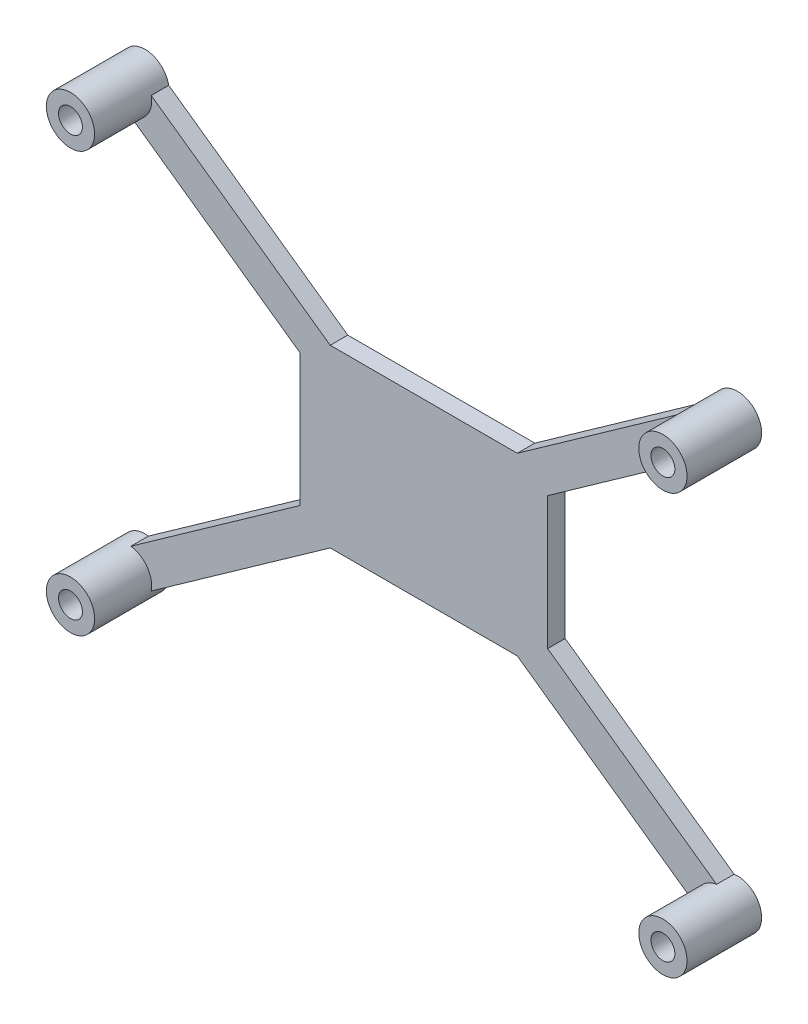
ISO-10303-21;
HEADER;
FILE_DESCRIPTION(('STEP AP214'),'2;1');
FILE_NAME('part.step','',(''),(''),'','','');
FILE_SCHEMA(('AUTOMOTIVE_DESIGN { 1 0 10303 214 1 1 1 1 }'));
ENDSEC;
DATA;
#1=APPLICATION_CONTEXT('core data for automotive mechanical design processes');
#2=APPLICATION_PROTOCOL_DEFINITION('international standard','automotive_design',2000,#1);
#3=PRODUCT_CONTEXT('',#1,'mechanical');
#4=PRODUCT('Part','Part','',(#3));
#5=PRODUCT_RELATED_PRODUCT_CATEGORY('part','',(#4));
#6=PRODUCT_DEFINITION_FORMATION('','',#4);
#7=PRODUCT_DEFINITION_CONTEXT('part definition',#1,'design');
#8=PRODUCT_DEFINITION('design','',#6,#7);
#9=PRODUCT_DEFINITION_SHAPE('','',#8);
#10=(LENGTH_UNIT() NAMED_UNIT(*) SI_UNIT(.MILLI.,.METRE.));
#11=(NAMED_UNIT(*) PLANE_ANGLE_UNIT() SI_UNIT($,.RADIAN.));
#12=(NAMED_UNIT(*) SI_UNIT($,.STERADIAN.) SOLID_ANGLE_UNIT());
#13=UNCERTAINTY_MEASURE_WITH_UNIT(LENGTH_MEASURE(1.E-05),#10,'distance_accuracy_value','');
#14=(GEOMETRIC_REPRESENTATION_CONTEXT(3) GLOBAL_UNCERTAINTY_ASSIGNED_CONTEXT((#13)) GLOBAL_UNIT_ASSIGNED_CONTEXT((#10,
#11,#12)) REPRESENTATION_CONTEXT('',''));
#15=CARTESIAN_POINT('',(0.,0.,0.));
#16=DIRECTION('',(0.,0.,1.));
#17=DIRECTION('',(1.,0.,0.));
#18=AXIS2_PLACEMENT_3D('',#15,#16,#17);
#19=CARTESIAN_POINT('',(-42.8625000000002,30.3625000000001,2.54));
#20=DIRECTION('',(0.,0.,1.));
#21=DIRECTION('',(1.,0.,0.));
#22=AXIS2_PLACEMENT_3D('',#19,#20,#21);
#23=PLANE('',#22);
#24=DIRECTION('',(0.816010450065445,0.57803714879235,0.));
#25=VECTOR('',#24,1.);
#26=CARTESIAN_POINT('',(42.3746782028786,26.9042365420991,2.54));
#27=LINE('',#26,#25);
#28=CARTESIAN_POINT('',(17.9284890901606,9.58729476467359,2.54));
#29=VERTEX_POINT('',#28);
#30=CARTESIAN_POINT('',(42.3746782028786,26.9042365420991,2.54));
#31=VERTEX_POINT('',#30);
#32=EDGE_CURVE('E158',#29,#31,#27,.T.);
#33=ORIENTED_EDGE('',*,*,#32,.T.);
#34=CARTESIAN_POINT('',(42.8624999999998,30.3625000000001,2.54));
#35=DIRECTION('',(0.,0.,1.));
#36=DIRECTION('',(1.,0.,0.));
#37=AXIS2_PLACEMENT_3D('',#34,#35,#36);
#38=CIRCLE('',#37,3.4925);
#39=CARTESIAN_POINT('',(39.4382494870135,31.0495696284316,2.54));
#40=VERTEX_POINT('',#39);
#41=EDGE_CURVE('E154',#40,#31,#38,.T.);
#42=ORIENTED_EDGE('',*,*,#41,.F.);
#43=DIRECTION('',(-0.816010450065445,-0.57803714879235,0.));
#44=VECTOR('',#43,1.);
#45=CARTESIAN_POINT('',(39.4382494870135,31.0495696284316,2.54));
#46=LINE('',#45,#44);
#47=CARTESIAN_POINT('',(13.5343078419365,12.7,2.54));
#48=VERTEX_POINT('',#47);
#49=EDGE_CURVE('E148',#40,#48,#46,.T.);
#50=ORIENTED_EDGE('',*,*,#49,.T.);
#51=DIRECTION('',(-1.,0.,0.));
#52=VECTOR('',#51,1.);
#53=CARTESIAN_POINT('',(13.5343078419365,12.7,2.54));
#54=LINE('',#53,#52);
#55=CARTESIAN_POINT('',(-13.5343078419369,12.7,2.54));
#56=VERTEX_POINT('',#55);
#57=EDGE_CURVE('E151',#48,#56,#54,.T.);
#58=ORIENTED_EDGE('',*,*,#57,.T.);
#59=DIRECTION('',(-0.816010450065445,0.57803714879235,0.));
#60=VECTOR('',#59,1.);
#61=CARTESIAN_POINT('',(-39.4382494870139,31.0495696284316,2.54));
#62=LINE('',#61,#60);
#63=CARTESIAN_POINT('',(-39.4382494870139,31.0495696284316,2.54));
#64=VERTEX_POINT('',#63);
#65=EDGE_CURVE('E52',#56,#64,#62,.T.);
#66=ORIENTED_EDGE('',*,*,#65,.T.);
#67=CARTESIAN_POINT('',(-42.8625000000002,30.3625000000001,2.54));
#68=DIRECTION('',(0.,0.,1.));
#69=DIRECTION('',(1.,0.,0.));
#70=AXIS2_PLACEMENT_3D('',#67,#68,#69);
#71=CIRCLE('',#70,3.4925);
#72=CARTESIAN_POINT('',(-42.374678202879,26.9042365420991,2.54));
#73=VERTEX_POINT('',#72);
#74=EDGE_CURVE('E292',#73,#64,#71,.T.);
#75=ORIENTED_EDGE('',*,*,#74,.F.);
#76=DIRECTION('',(0.816010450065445,-0.57803714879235,0.));
#77=VECTOR('',#76,1.);
#78=CARTESIAN_POINT('',(-42.374678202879,26.9042365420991,2.54));
#79=LINE('',#78,#77);
#80=CARTESIAN_POINT('',(-17.9284890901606,9.58729476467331,2.54));
#81=VERTEX_POINT('',#80);
#82=EDGE_CURVE('E119',#73,#81,#79,.T.);
#83=ORIENTED_EDGE('',*,*,#82,.T.);
#84=DIRECTION('',(0.,-1.,0.));
#85=VECTOR('',#84,1.);
#86=CARTESIAN_POINT('',(-17.9284890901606,-9.58729476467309,2.54));
#87=LINE('',#86,#85);
#88=CARTESIAN_POINT('',(-17.9284890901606,-9.58729476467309,2.54));
#89=VERTEX_POINT('',#88);
#90=EDGE_CURVE('E259',#81,#89,#87,.T.);
#91=ORIENTED_EDGE('',*,*,#90,.T.);
#92=DIRECTION('',(-0.816010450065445,-0.57803714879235,0.));
#93=VECTOR('',#92,1.);
#94=CARTESIAN_POINT('',(-17.9284890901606,-9.58729476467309,2.54));
#95=LINE('',#94,#93);
#96=CARTESIAN_POINT('',(-42.374678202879,-26.9042365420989,2.54));
#97=VERTEX_POINT('',#96);
#98=EDGE_CURVE('E261',#89,#97,#95,.T.);
#99=ORIENTED_EDGE('',*,*,#98,.T.);
#100=CARTESIAN_POINT('',(-42.8625000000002,-30.3624999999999,2.54));
#101=DIRECTION('',(0.,0.,1.));
#102=DIRECTION('',(1.,0.,0.));
#103=AXIS2_PLACEMENT_3D('',#100,#101,#102);
#104=CIRCLE('',#103,3.4925);
#105=CARTESIAN_POINT('',(-39.4382494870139,-31.0495696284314,2.54));
#106=VERTEX_POINT('',#105);
#107=EDGE_CURVE('E301',#106,#97,#104,.T.);
#108=ORIENTED_EDGE('',*,*,#107,.F.);
#109=DIRECTION('',(0.816010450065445,0.57803714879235,0.));
#110=VECTOR('',#109,1.);
#111=CARTESIAN_POINT('',(-13.5343078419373,-12.7,2.54));
#112=LINE('',#111,#110);
#113=CARTESIAN_POINT('',(-13.5343078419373,-12.7,2.54));
#114=VERTEX_POINT('',#113);
#115=EDGE_CURVE('E264',#106,#114,#112,.T.);
#116=ORIENTED_EDGE('',*,*,#115,.T.);
#117=DIRECTION('',(1.,0.,0.));
#118=VECTOR('',#117,1.);
#119=CARTESIAN_POINT('',(13.5343078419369,-12.7,2.54));
#120=LINE('',#119,#118);
#121=CARTESIAN_POINT('',(13.5343078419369,-12.7,2.54));
#122=VERTEX_POINT('',#121);
#123=EDGE_CURVE('E266',#114,#122,#120,.T.);
#124=ORIENTED_EDGE('',*,*,#123,.T.);
#125=DIRECTION('',(0.816010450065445,-0.57803714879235,0.));
#126=VECTOR('',#125,1.);
#127=CARTESIAN_POINT('',(13.5343078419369,-12.7,2.54));
#128=LINE('',#127,#126);
#129=CARTESIAN_POINT('',(39.4382494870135,-31.0495696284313,2.54));
#130=VERTEX_POINT('',#129);
#131=EDGE_CURVE('E268',#122,#130,#128,.T.);
#132=ORIENTED_EDGE('',*,*,#131,.T.);
#133=CARTESIAN_POINT('',(42.8624999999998,-30.3624999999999,2.54));
#134=DIRECTION('',(0.,0.,1.));
#135=DIRECTION('',(1.,0.,0.));
#136=AXIS2_PLACEMENT_3D('',#133,#134,#135);
#137=CIRCLE('',#136,3.4925);
#138=CARTESIAN_POINT('',(42.3746782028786,-26.9042365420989,2.54));
#139=VERTEX_POINT('',#138);
#140=EDGE_CURVE('E248',#139,#130,#137,.T.);
#141=ORIENTED_EDGE('',*,*,#140,.F.);
#142=DIRECTION('',(-0.816010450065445,0.57803714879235,0.));
#143=VECTOR('',#142,1.);
#144=CARTESIAN_POINT('',(17.9284890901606,-9.58729476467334,2.54));
#145=LINE('',#144,#143);
#146=CARTESIAN_POINT('',(17.9284890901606,-9.58729476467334,2.54));
#147=VERTEX_POINT('',#146);
#148=EDGE_CURVE('E245',#139,#147,#145,.T.);
#149=ORIENTED_EDGE('',*,*,#148,.T.);
#150=DIRECTION('',(0.,1.,0.));
#151=VECTOR('',#150,1.);
#152=CARTESIAN_POINT('',(17.9284890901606,-9.58729476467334,2.54));
#153=LINE('',#152,#151);
#154=EDGE_CURVE('E269',#147,#29,#153,.T.);
#155=ORIENTED_EDGE('',*,*,#154,.T.);
#156=EDGE_LOOP('',(#33,#42,#50,#58,#66,#75,#83,#91,#99,#108,#116,#124,#132,#141,#149,#155));
#157=FACE_BOUND('',#156,.T.);
#158=ADVANCED_FACE('F33',(#157),#23,.T.);
#159=CARTESIAN_POINT('',(-42.8625000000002,30.3625000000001,2.54));
#160=DIRECTION('',(0.,0.,-1.));
#161=DIRECTION('',(-1.,0.,0.));
#162=AXIS2_PLACEMENT_3D('',#159,#160,#161);
#163=CYLINDRICAL_SURFACE('',#162,3.4925);
#164=CARTESIAN_POINT('',(-42.8625000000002,30.3625000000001,0.));
#165=DIRECTION('',(0.,0.,1.));
#166=DIRECTION('',(1.,0.,0.));
#167=AXIS2_PLACEMENT_3D('',#164,#165,#166);
#168=CIRCLE('',#167,3.4925);
#169=CARTESIAN_POINT('',(-39.4382494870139,31.0495696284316,0.));
#170=VERTEX_POINT('',#169);
#171=CARTESIAN_POINT('',(-42.374678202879,26.9042365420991,0.));
#172=VERTEX_POINT('',#171);
#173=EDGE_CURVE('E173',#170,#172,#168,.T.);
#174=ORIENTED_EDGE('',*,*,#173,.T.);
#175=DIRECTION('',(0.,0.,-1.));
#176=VECTOR('',#175,1.);
#177=CARTESIAN_POINT('',(-42.374678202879,26.9042365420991,2.54));
#178=LINE('',#177,#176);
#179=EDGE_CURVE('E11',#73,#172,#178,.T.);
#180=ORIENTED_EDGE('',*,*,#179,.F.);
#181=ORIENTED_EDGE('',*,*,#74,.T.);
#182=DIRECTION('',(0.,0.,-1.));
#183=VECTOR('',#182,1.);
#184=CARTESIAN_POINT('',(-39.4382494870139,31.0495696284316,2.54));
#185=LINE('',#184,#183);
#186=EDGE_CURVE('E169',#64,#170,#185,.T.);
#187=ORIENTED_EDGE('',*,*,#186,.T.);
#188=EDGE_LOOP('',(#174,#180,#181,#187));
#189=FACE_BOUND('',#188,.T.);
#190=CARTESIAN_POINT('',(-42.8625000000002,30.3625000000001,10.795));
#191=DIRECTION('',(0.,0.,1.));
#192=DIRECTION('',(1.,0.,0.));
#193=AXIS2_PLACEMENT_3D('',#190,#191,#192);
#194=CIRCLE('',#193,3.4925);
#195=CARTESIAN_POINT('',(-39.3700000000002,30.3625000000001,10.795));
#196=VERTEX_POINT('',#195);
#197=EDGE_CURVE('E293',#196,#196,#194,.T.);
#198=ORIENTED_EDGE('',*,*,#197,.F.);
#199=EDGE_LOOP('',(#198));
#200=FACE_BOUND('',#199,.T.);
#201=ADVANCED_FACE('F35',(#189,#200),#163,.T.);
#202=CARTESIAN_POINT('',(-42.374678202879,26.9042365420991,2.54));
#203=DIRECTION('',(0.57803714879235,0.816010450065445,0.));
#204=DIRECTION('',(-0.816010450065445,0.57803714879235,0.));
#205=AXIS2_PLACEMENT_3D('',#202,#203,#204);
#206=PLANE('',#205);
#207=DIRECTION('',(0.816010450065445,-0.57803714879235,0.));
#208=VECTOR('',#207,1.);
#209=CARTESIAN_POINT('',(-42.374678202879,26.9042365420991,0.));
#210=LINE('',#209,#208);
#211=CARTESIAN_POINT('',(-17.9284890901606,9.58729476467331,0.));
#212=VERTEX_POINT('',#211);
#213=EDGE_CURVE('E176',#172,#212,#210,.T.);
#214=ORIENTED_EDGE('',*,*,#213,.T.);
#215=DIRECTION('',(0.,0.,-1.));
#216=VECTOR('',#215,1.);
#217=CARTESIAN_POINT('',(-17.9284890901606,9.58729476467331,2.54));
#218=LINE('',#217,#216);
#219=EDGE_CURVE('E43',#81,#212,#218,.T.);
#220=ORIENTED_EDGE('',*,*,#219,.F.);
#221=ORIENTED_EDGE('',*,*,#82,.F.);
#222=ORIENTED_EDGE('',*,*,#179,.T.);
#223=EDGE_LOOP('',(#214,#220,#221,#222));
#224=FACE_BOUND('',#223,.T.);
#225=ADVANCED_FACE('F333',(#224),#206,.F.);
#226=CARTESIAN_POINT('',(-17.9284890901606,-9.58729476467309,2.54));
#227=DIRECTION('',(1.,0.,0.));
#228=DIRECTION('',(0.,0.,-1.));
#229=AXIS2_PLACEMENT_3D('',#226,#227,#228);
#230=PLANE('',#229);
#231=DIRECTION('',(0.,-1.,0.));
#232=VECTOR('',#231,1.);
#233=CARTESIAN_POINT('',(-17.9284890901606,-9.58729476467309,0.));
#234=LINE('',#233,#232);
#235=CARTESIAN_POINT('',(-17.9284890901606,-9.58729476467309,0.));
#236=VERTEX_POINT('',#235);
#237=EDGE_CURVE('E179',#212,#236,#234,.T.);
#238=ORIENTED_EDGE('',*,*,#237,.T.);
#239=DIRECTION('',(0.,0.,-1.));
#240=VECTOR('',#239,1.);
#241=CARTESIAN_POINT('',(-17.9284890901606,-9.58729476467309,2.54));
#242=LINE('',#241,#240);
#243=EDGE_CURVE('E230',#89,#236,#242,.T.);
#244=ORIENTED_EDGE('',*,*,#243,.F.);
#245=ORIENTED_EDGE('',*,*,#90,.F.);
#246=ORIENTED_EDGE('',*,*,#219,.T.);
#247=EDGE_LOOP('',(#238,#244,#245,#246));
#248=FACE_BOUND('',#247,.T.);
#249=ADVANCED_FACE('F384',(#248),#230,.F.);
#250=CARTESIAN_POINT('',(-17.9284890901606,-9.58729476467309,2.54));
#251=DIRECTION('',(0.57803714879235,-0.816010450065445,0.));
#252=DIRECTION('',(0.816010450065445,0.57803714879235,0.));
#253=AXIS2_PLACEMENT_3D('',#250,#251,#252);
#254=PLANE('',#253);
#255=DIRECTION('',(-0.816010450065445,-0.57803714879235,0.));
#256=VECTOR('',#255,1.);
#257=CARTESIAN_POINT('',(-17.9284890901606,-9.58729476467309,0.));
#258=LINE('',#257,#256);
#259=CARTESIAN_POINT('',(-42.374678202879,-26.9042365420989,0.));
#260=VERTEX_POINT('',#259);
#261=EDGE_CURVE('E181',#236,#260,#258,.T.);
#262=ORIENTED_EDGE('',*,*,#261,.T.);
#263=DIRECTION('',(0.,0.,-1.));
#264=VECTOR('',#263,1.);
#265=CARTESIAN_POINT('',(-42.374678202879,-26.9042365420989,2.54));
#266=LINE('',#265,#264);
#267=EDGE_CURVE('E227',#97,#260,#266,.T.);
#268=ORIENTED_EDGE('',*,*,#267,.F.);
#269=ORIENTED_EDGE('',*,*,#98,.F.);
#270=ORIENTED_EDGE('',*,*,#243,.T.);
#271=EDGE_LOOP('',(#262,#268,#269,#270));
#272=FACE_BOUND('',#271,.T.);
#273=ADVANCED_FACE('F380',(#272),#254,.F.);
#274=CARTESIAN_POINT('',(-42.8625000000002,-30.3624999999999,2.54));
#275=DIRECTION('',(0.,0.,-1.));
#276=DIRECTION('',(-1.,0.,0.));
#277=AXIS2_PLACEMENT_3D('',#274,#275,#276);
#278=CYLINDRICAL_SURFACE('',#277,3.4925);
#279=CARTESIAN_POINT('',(-42.8625000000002,-30.3624999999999,0.));
#280=DIRECTION('',(0.,0.,1.));
#281=DIRECTION('',(1.,0.,0.));
#282=AXIS2_PLACEMENT_3D('',#279,#280,#281);
#283=CIRCLE('',#282,3.4925);
#284=CARTESIAN_POINT('',(-39.4382494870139,-31.0495696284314,0.));
#285=VERTEX_POINT('',#284);
#286=EDGE_CURVE('E183',#260,#285,#283,.T.);
#287=ORIENTED_EDGE('',*,*,#286,.T.);
#288=DIRECTION('',(0.,0.,-1.));
#289=VECTOR('',#288,1.);
#290=CARTESIAN_POINT('',(-39.4382494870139,-31.0495696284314,2.54));
#291=LINE('',#290,#289);
#292=EDGE_CURVE('E224',#106,#285,#291,.T.);
#293=ORIENTED_EDGE('',*,*,#292,.F.);
#294=ORIENTED_EDGE('',*,*,#107,.T.);
#295=ORIENTED_EDGE('',*,*,#267,.T.);
#296=EDGE_LOOP('',(#287,#293,#294,#295));
#297=FACE_BOUND('',#296,.T.);
#298=CARTESIAN_POINT('',(-42.8625000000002,-30.3624999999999,10.795));
#299=DIRECTION('',(0.,0.,1.));
#300=DIRECTION('',(1.,0.,0.));
#301=AXIS2_PLACEMENT_3D('',#298,#299,#300);
#302=CIRCLE('',#301,3.4925);
#303=CARTESIAN_POINT('',(-39.3700000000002,-30.3624999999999,10.795));
#304=VERTEX_POINT('',#303);
#305=EDGE_CURVE('E302',#304,#304,#302,.T.);
#306=ORIENTED_EDGE('',*,*,#305,.F.);
#307=EDGE_LOOP('',(#306));
#308=FACE_BOUND('',#307,.T.);
#309=ADVANCED_FACE('F376',(#297,#308),#278,.T.);
#310=CARTESIAN_POINT('',(-13.5343078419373,-12.7,2.54));
#311=DIRECTION('',(-0.57803714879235,0.816010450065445,0.));
#312=DIRECTION('',(-0.816010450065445,-0.57803714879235,0.));
#313=AXIS2_PLACEMENT_3D('',#310,#311,#312);
#314=PLANE('',#313);
#315=DIRECTION('',(0.816010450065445,0.57803714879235,0.));
#316=VECTOR('',#315,1.);
#317=CARTESIAN_POINT('',(-13.5343078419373,-12.7,0.));
#318=LINE('',#317,#316);
#319=CARTESIAN_POINT('',(-13.5343078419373,-12.7,0.));
#320=VERTEX_POINT('',#319);
#321=EDGE_CURVE('E185',#285,#320,#318,.T.);
#322=ORIENTED_EDGE('',*,*,#321,.T.);
#323=DIRECTION('',(0.,0.,-1.));
#324=VECTOR('',#323,1.);
#325=CARTESIAN_POINT('',(-13.5343078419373,-12.7,2.54));
#326=LINE('',#325,#324);
#327=EDGE_CURVE('E220',#114,#320,#326,.T.);
#328=ORIENTED_EDGE('',*,*,#327,.F.);
#329=ORIENTED_EDGE('',*,*,#115,.F.);
#330=ORIENTED_EDGE('',*,*,#292,.T.);
#331=EDGE_LOOP('',(#322,#328,#329,#330));
#332=FACE_BOUND('',#331,.T.);
#333=ADVANCED_FACE('F372',(#332),#314,.F.);
#334=CARTESIAN_POINT('',(13.5343078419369,-12.7,2.54));
#335=DIRECTION('',(0.,1.,0.));
#336=DIRECTION('',(-1.,0.,0.));
#337=AXIS2_PLACEMENT_3D('',#334,#335,#336);
#338=PLANE('',#337);
#339=DIRECTION('',(1.,0.,0.));
#340=VECTOR('',#339,1.);
#341=CARTESIAN_POINT('',(13.5343078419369,-12.7,0.));
#342=LINE('',#341,#340);
#343=CARTESIAN_POINT('',(13.5343078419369,-12.7,0.));
#344=VERTEX_POINT('',#343);
#345=EDGE_CURVE('E187',#320,#344,#342,.T.);
#346=ORIENTED_EDGE('',*,*,#345,.T.);
#347=DIRECTION('',(0.,0.,-1.));
#348=VECTOR('',#347,1.);
#349=CARTESIAN_POINT('',(13.5343078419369,-12.7,2.54));
#350=LINE('',#349,#348);
#351=EDGE_CURVE('E217',#122,#344,#350,.T.);
#352=ORIENTED_EDGE('',*,*,#351,.F.);
#353=ORIENTED_EDGE('',*,*,#123,.F.);
#354=ORIENTED_EDGE('',*,*,#327,.T.);
#355=EDGE_LOOP('',(#346,#352,#353,#354));
#356=FACE_BOUND('',#355,.T.);
#357=ADVANCED_FACE('F368',(#356),#338,.F.);
#358=CARTESIAN_POINT('',(13.5343078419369,-12.7,2.54));
#359=DIRECTION('',(0.57803714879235,0.816010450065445,0.));
#360=DIRECTION('',(-0.816010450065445,0.57803714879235,0.));
#361=AXIS2_PLACEMENT_3D('',#358,#359,#360);
#362=PLANE('',#361);
#363=DIRECTION('',(0.816010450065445,-0.57803714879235,0.));
#364=VECTOR('',#363,1.);
#365=CARTESIAN_POINT('',(13.5343078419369,-12.7,0.));
#366=LINE('',#365,#364);
#367=CARTESIAN_POINT('',(39.4382494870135,-31.0495696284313,0.));
#368=VERTEX_POINT('',#367);
#369=EDGE_CURVE('E189',#344,#368,#366,.T.);
#370=ORIENTED_EDGE('',*,*,#369,.T.);
#371=DIRECTION('',(0.,0.,-1.));
#372=VECTOR('',#371,1.);
#373=CARTESIAN_POINT('',(39.4382494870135,-31.0495696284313,2.54));
#374=LINE('',#373,#372);
#375=EDGE_CURVE('E221',#130,#368,#374,.T.);
#376=ORIENTED_EDGE('',*,*,#375,.F.);
#377=ORIENTED_EDGE('',*,*,#131,.F.);
#378=ORIENTED_EDGE('',*,*,#351,.T.);
#379=EDGE_LOOP('',(#370,#376,#377,#378));
#380=FACE_BOUND('',#379,.T.);
#381=ADVANCED_FACE('F364',(#380),#362,.F.);
#382=CARTESIAN_POINT('',(42.8624999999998,-30.3624999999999,2.54));
#383=DIRECTION('',(0.,0.,-1.));
#384=DIRECTION('',(-1.,0.,0.));
#385=AXIS2_PLACEMENT_3D('',#382,#383,#384);
#386=CYLINDRICAL_SURFACE('',#385,3.4925);
#387=CARTESIAN_POINT('',(42.8624999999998,-30.3624999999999,0.));
#388=DIRECTION('',(0.,0.,1.));
#389=DIRECTION('',(1.,0.,0.));
#390=AXIS2_PLACEMENT_3D('',#387,#388,#389);
#391=CIRCLE('',#390,3.4925);
#392=CARTESIAN_POINT('',(42.3746782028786,-26.9042365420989,0.));
#393=VERTEX_POINT('',#392);
#394=EDGE_CURVE('E191',#368,#393,#391,.T.);
#395=ORIENTED_EDGE('',*,*,#394,.T.);
#396=DIRECTION('',(0.,0.,-1.));
#397=VECTOR('',#396,1.);
#398=CARTESIAN_POINT('',(42.3746782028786,-26.9042365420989,2.54));
#399=LINE('',#398,#397);
#400=EDGE_CURVE('E216',#139,#393,#399,.T.);
#401=ORIENTED_EDGE('',*,*,#400,.F.);
#402=ORIENTED_EDGE('',*,*,#140,.T.);
#403=ORIENTED_EDGE('',*,*,#375,.T.);
#404=EDGE_LOOP('',(#395,#401,#402,#403));
#405=FACE_BOUND('',#404,.T.);
#406=CARTESIAN_POINT('',(42.8624999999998,-30.3624999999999,10.795));
#407=DIRECTION('',(0.,0.,1.));
#408=DIRECTION('',(1.,0.,0.));
#409=AXIS2_PLACEMENT_3D('',#406,#407,#408);
#410=CIRCLE('',#409,3.4925);
#411=CARTESIAN_POINT('',(46.3549999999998,-30.3624999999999,10.795));
#412=VERTEX_POINT('',#411);
#413=EDGE_CURVE('E242',#412,#412,#410,.T.);
#414=ORIENTED_EDGE('',*,*,#413,.F.);
#415=EDGE_LOOP('',(#414));
#416=FACE_BOUND('',#415,.T.);
#417=ADVANCED_FACE('F360',(#405,#416),#386,.T.);
#418=CARTESIAN_POINT('',(17.9284890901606,-9.58729476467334,2.54));
#419=DIRECTION('',(-0.57803714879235,-0.816010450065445,0.));
#420=DIRECTION('',(0.816010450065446,-0.57803714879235,0.));
#421=AXIS2_PLACEMENT_3D('',#418,#419,#420);
#422=PLANE('',#421);
#423=DIRECTION('',(-0.816010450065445,0.57803714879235,0.));
#424=VECTOR('',#423,1.);
#425=CARTESIAN_POINT('',(17.9284890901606,-9.58729476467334,0.));
#426=LINE('',#425,#424);
#427=CARTESIAN_POINT('',(17.9284890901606,-9.58729476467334,0.));
#428=VERTEX_POINT('',#427);
#429=EDGE_CURVE('E193',#393,#428,#426,.T.);
#430=ORIENTED_EDGE('',*,*,#429,.T.);
#431=DIRECTION('',(0.,0.,-1.));
#432=VECTOR('',#431,1.);
#433=CARTESIAN_POINT('',(17.9284890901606,-9.58729476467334,2.54));
#434=LINE('',#433,#432);
#435=EDGE_CURVE('E213',#147,#428,#434,.T.);
#436=ORIENTED_EDGE('',*,*,#435,.F.);
#437=ORIENTED_EDGE('',*,*,#148,.F.);
#438=ORIENTED_EDGE('',*,*,#400,.T.);
#439=EDGE_LOOP('',(#430,#436,#437,#438));
#440=FACE_BOUND('',#439,.T.);
#441=ADVANCED_FACE('F356',(#440),#422,.F.);
#442=CARTESIAN_POINT('',(17.9284890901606,-9.58729476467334,2.54));
#443=DIRECTION('',(-1.,0.,0.));
#444=DIRECTION('',(0.,0.,1.));
#445=AXIS2_PLACEMENT_3D('',#442,#443,#444);
#446=PLANE('',#445);
#447=DIRECTION('',(0.,1.,0.));
#448=VECTOR('',#447,1.);
#449=CARTESIAN_POINT('',(17.9284890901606,-9.58729476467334,0.));
#450=LINE('',#449,#448);
#451=CARTESIAN_POINT('',(17.9284890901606,9.58729476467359,0.));
#452=VERTEX_POINT('',#451);
#453=EDGE_CURVE('E195',#428,#452,#450,.T.);
#454=ORIENTED_EDGE('',*,*,#453,.T.);
#455=DIRECTION('',(0.,0.,-1.));
#456=VECTOR('',#455,1.);
#457=CARTESIAN_POINT('',(17.9284890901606,9.58729476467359,2.54));
#458=LINE('',#457,#456);
#459=EDGE_CURVE('E210',#29,#452,#458,.T.);
#460=ORIENTED_EDGE('',*,*,#459,.F.);
#461=ORIENTED_EDGE('',*,*,#154,.F.);
#462=ORIENTED_EDGE('',*,*,#435,.T.);
#463=EDGE_LOOP('',(#454,#460,#461,#462));
#464=FACE_BOUND('',#463,.T.);
#465=ADVANCED_FACE('F353',(#464),#446,.F.);
#466=CARTESIAN_POINT('',(42.3746782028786,26.9042365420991,2.54));
#467=DIRECTION('',(-0.57803714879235,0.816010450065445,0.));
#468=DIRECTION('',(-0.816010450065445,-0.57803714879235,0.));
#469=AXIS2_PLACEMENT_3D('',#466,#467,#468);
#470=PLANE('',#469);
#471=DIRECTION('',(0.816010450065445,0.57803714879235,0.));
#472=VECTOR('',#471,1.);
#473=CARTESIAN_POINT('',(42.3746782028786,26.9042365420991,0.));
#474=LINE('',#473,#472);
#475=CARTESIAN_POINT('',(42.3746782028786,26.9042365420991,0.));
#476=VERTEX_POINT('',#475);
#477=EDGE_CURVE('E197',#452,#476,#474,.T.);
#478=ORIENTED_EDGE('',*,*,#477,.T.);
#479=DIRECTION('',(0.,0.,-1.));
#480=VECTOR('',#479,1.);
#481=CARTESIAN_POINT('',(42.3746782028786,26.9042365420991,2.54));
#482=LINE('',#481,#480);
#483=EDGE_CURVE('E207',#31,#476,#482,.T.);
#484=ORIENTED_EDGE('',*,*,#483,.F.);
#485=ORIENTED_EDGE('',*,*,#32,.F.);
#486=ORIENTED_EDGE('',*,*,#459,.T.);
#487=EDGE_LOOP('',(#478,#484,#485,#486));
#488=FACE_BOUND('',#487,.T.);
#489=ADVANCED_FACE('F275',(#488),#470,.F.);
#490=CARTESIAN_POINT('',(42.8624999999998,30.3625000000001,2.54));
#491=DIRECTION('',(0.,0.,-1.));
#492=DIRECTION('',(-1.,0.,0.));
#493=AXIS2_PLACEMENT_3D('',#490,#491,#492);
#494=CYLINDRICAL_SURFACE('',#493,3.4925);
#495=CARTESIAN_POINT('',(42.8624999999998,30.3625000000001,0.));
#496=DIRECTION('',(0.,0.,1.));
#497=DIRECTION('',(1.,0.,0.));
#498=AXIS2_PLACEMENT_3D('',#495,#496,#497);
#499=CIRCLE('',#498,3.4925);
#500=CARTESIAN_POINT('',(39.4382494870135,31.0495696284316,0.));
#501=VERTEX_POINT('',#500);
#502=EDGE_CURVE('E199',#476,#501,#499,.T.);
#503=ORIENTED_EDGE('',*,*,#502,.T.);
#504=DIRECTION('',(0.,0.,-1.));
#505=VECTOR('',#504,1.);
#506=CARTESIAN_POINT('',(39.4382494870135,31.0495696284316,2.54));
#507=LINE('',#506,#505);
#508=EDGE_CURVE('E164',#40,#501,#507,.T.);
#509=ORIENTED_EDGE('',*,*,#508,.F.);
#510=ORIENTED_EDGE('',*,*,#41,.T.);
#511=ORIENTED_EDGE('',*,*,#483,.T.);
#512=EDGE_LOOP('',(#503,#509,#510,#511));
#513=FACE_BOUND('',#512,.T.);
#514=CARTESIAN_POINT('',(42.8624999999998,30.3625000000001,10.795));
#515=DIRECTION('',(0.,0.,1.));
#516=DIRECTION('',(1.,0.,0.));
#517=AXIS2_PLACEMENT_3D('',#514,#515,#516);
#518=CIRCLE('',#517,3.4925);
#519=CARTESIAN_POINT('',(46.3549999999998,30.3625000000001,10.795));
#520=VERTEX_POINT('',#519);
#521=EDGE_CURVE('E281',#520,#520,#518,.T.);
#522=ORIENTED_EDGE('',*,*,#521,.F.);
#523=EDGE_LOOP('',(#522));
#524=FACE_BOUND('',#523,.T.);
#525=ADVANCED_FACE('F279',(#513,#524),#494,.T.);
#526=CARTESIAN_POINT('',(39.4382494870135,31.0495696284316,2.54));
#527=DIRECTION('',(0.57803714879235,-0.816010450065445,0.));
#528=DIRECTION('',(0.816010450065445,0.57803714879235,0.));
#529=AXIS2_PLACEMENT_3D('',#526,#527,#528);
#530=PLANE('',#529);
#531=DIRECTION('',(-0.816010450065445,-0.57803714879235,0.));
#532=VECTOR('',#531,1.);
#533=CARTESIAN_POINT('',(39.4382494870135,31.0495696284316,0.));
#534=LINE('',#533,#532);
#535=CARTESIAN_POINT('',(13.5343078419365,12.7,0.));
#536=VERTEX_POINT('',#535);
#537=EDGE_CURVE('E163',#501,#536,#534,.T.);
#538=ORIENTED_EDGE('',*,*,#537,.T.);
#539=DIRECTION('',(0.,0.,-1.));
#540=VECTOR('',#539,1.);
#541=CARTESIAN_POINT('',(13.5343078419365,12.7,2.54));
#542=LINE('',#541,#540);
#543=EDGE_CURVE('E160',#48,#536,#542,.T.);
#544=ORIENTED_EDGE('',*,*,#543,.F.);
#545=ORIENTED_EDGE('',*,*,#49,.F.);
#546=ORIENTED_EDGE('',*,*,#508,.T.);
#547=EDGE_LOOP('',(#538,#544,#545,#546));
#548=FACE_BOUND('',#547,.T.);
#549=ADVANCED_FACE('F161',(#548),#530,.F.);
#550=CARTESIAN_POINT('',(13.5343078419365,12.7,2.54));
#551=DIRECTION('',(0.,-1.,0.));
#552=DIRECTION('',(1.,0.,0.));
#553=AXIS2_PLACEMENT_3D('',#550,#551,#552);
#554=PLANE('',#553);
#555=DIRECTION('',(-1.,0.,0.));
#556=VECTOR('',#555,1.);
#557=CARTESIAN_POINT('',(13.5343078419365,12.7,0.));
#558=LINE('',#557,#556);
#559=CARTESIAN_POINT('',(-13.5343078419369,12.7,0.));
#560=VERTEX_POINT('',#559);
#561=EDGE_CURVE('E106',#536,#560,#558,.T.);
#562=ORIENTED_EDGE('',*,*,#561,.T.);
#563=DIRECTION('',(0.,0.,-1.));
#564=VECTOR('',#563,1.);
#565=CARTESIAN_POINT('',(-13.5343078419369,12.7,2.54));
#566=LINE('',#565,#564);
#567=EDGE_CURVE('E165',#56,#560,#566,.T.);
#568=ORIENTED_EDGE('',*,*,#567,.F.);
#569=ORIENTED_EDGE('',*,*,#57,.F.);
#570=ORIENTED_EDGE('',*,*,#543,.T.);
#571=EDGE_LOOP('',(#562,#568,#569,#570));
#572=FACE_BOUND('',#571,.T.);
#573=ADVANCED_FACE('F167',(#572),#554,.F.);
#574=CARTESIAN_POINT('',(-39.4382494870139,31.0495696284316,2.54));
#575=DIRECTION('',(-0.57803714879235,-0.816010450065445,0.));
#576=DIRECTION('',(0.816010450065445,-0.57803714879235,0.));
#577=AXIS2_PLACEMENT_3D('',#574,#575,#576);
#578=PLANE('',#577);
#579=DIRECTION('',(-0.816010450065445,0.57803714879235,0.));
#580=VECTOR('',#579,1.);
#581=CARTESIAN_POINT('',(-39.4382494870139,31.0495696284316,0.));
#582=LINE('',#581,#580);
#583=EDGE_CURVE('E112',#560,#170,#582,.T.);
#584=ORIENTED_EDGE('',*,*,#583,.T.);
#585=ORIENTED_EDGE('',*,*,#186,.F.);
#586=ORIENTED_EDGE('',*,*,#65,.F.);
#587=ORIENTED_EDGE('',*,*,#567,.T.);
#588=EDGE_LOOP('',(#584,#585,#586,#587));
#589=FACE_BOUND('',#588,.T.);
#590=ADVANCED_FACE('F341',(#589),#578,.F.);
#591=CARTESIAN_POINT('',(-42.8625000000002,30.3625000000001,0.));
#592=DIRECTION('',(0.,0.,1.));
#593=DIRECTION('',(1.,0.,0.));
#594=AXIS2_PLACEMENT_3D('',#591,#592,#593);
#595=PLANE('',#594);
#596=CARTESIAN_POINT('',(-42.8625000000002,30.3625000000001,0.));
#597=DIRECTION('',(0.,0.,1.));
#598=DIRECTION('',(1.,0.,0.));
#599=AXIS2_PLACEMENT_3D('',#596,#597,#598);
#600=CIRCLE('',#599,1.72719999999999);
#601=CARTESIAN_POINT('',(-41.1353000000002,30.3625000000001,0.));
#602=VERTEX_POINT('',#601);
#603=EDGE_CURVE('E239',#602,#602,#600,.T.);
#604=ORIENTED_EDGE('',*,*,#603,.T.);
#605=EDGE_LOOP('',(#604));
#606=FACE_BOUND('',#605,.T.);
#607=CARTESIAN_POINT('',(42.8624999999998,30.3625000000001,0.));
#608=DIRECTION('',(0.,0.,1.));
#609=DIRECTION('',(1.,0.,0.));
#610=AXIS2_PLACEMENT_3D('',#607,#608,#609);
#611=CIRCLE('',#610,1.72719999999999);
#612=CARTESIAN_POINT('',(44.5896999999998,30.3625000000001,0.));
#613=VERTEX_POINT('',#612);
#614=EDGE_CURVE('E235',#613,#613,#611,.T.);
#615=ORIENTED_EDGE('',*,*,#614,.T.);
#616=EDGE_LOOP('',(#615));
#617=FACE_BOUND('',#616,.T.);
#618=CARTESIAN_POINT('',(-42.8625000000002,-30.3624999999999,0.));
#619=DIRECTION('',(0.,0.,1.));
#620=DIRECTION('',(1.,0.,0.));
#621=AXIS2_PLACEMENT_3D('',#618,#619,#620);
#622=CIRCLE('',#621,1.72719999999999);
#623=CARTESIAN_POINT('',(-41.1353000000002,-30.3624999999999,0.));
#624=VERTEX_POINT('',#623);
#625=EDGE_CURVE('E238',#624,#624,#622,.T.);
#626=ORIENTED_EDGE('',*,*,#625,.T.);
#627=EDGE_LOOP('',(#626));
#628=FACE_BOUND('',#627,.T.);
#629=CARTESIAN_POINT('',(42.8624999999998,-30.3624999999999,0.));
#630=DIRECTION('',(0.,0.,1.));
#631=DIRECTION('',(1.,0.,0.));
#632=AXIS2_PLACEMENT_3D('',#629,#630,#631);
#633=CIRCLE('',#632,1.72719999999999);
#634=CARTESIAN_POINT('',(44.5896999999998,-30.3624999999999,0.));
#635=VERTEX_POINT('',#634);
#636=EDGE_CURVE('E177',#635,#635,#633,.T.);
#637=ORIENTED_EDGE('',*,*,#636,.T.);
#638=EDGE_LOOP('',(#637));
#639=FACE_BOUND('',#638,.T.);
#640=ORIENTED_EDGE('',*,*,#173,.F.);
#641=ORIENTED_EDGE('',*,*,#583,.F.);
#642=ORIENTED_EDGE('',*,*,#561,.F.);
#643=ORIENTED_EDGE('',*,*,#537,.F.);
#644=ORIENTED_EDGE('',*,*,#502,.F.);
#645=ORIENTED_EDGE('',*,*,#477,.F.);
#646=ORIENTED_EDGE('',*,*,#453,.F.);
#647=ORIENTED_EDGE('',*,*,#429,.F.);
#648=ORIENTED_EDGE('',*,*,#394,.F.);
#649=ORIENTED_EDGE('',*,*,#369,.F.);
#650=ORIENTED_EDGE('',*,*,#345,.F.);
#651=ORIENTED_EDGE('',*,*,#321,.F.);
#652=ORIENTED_EDGE('',*,*,#286,.F.);
#653=ORIENTED_EDGE('',*,*,#261,.F.);
#654=ORIENTED_EDGE('',*,*,#237,.F.);
#655=ORIENTED_EDGE('',*,*,#213,.F.);
#656=EDGE_LOOP('',(#640,#641,#642,#643,#644,#645,#646,#647,#648,#649,#650,#651,#652,#653,#654,#655));
#657=FACE_BOUND('',#656,.T.);
#658=ADVANCED_FACE('F338',(#606,#617,#628,#639,#657),#595,.F.);
#659=CARTESIAN_POINT('',(42.8624999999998,-30.3624999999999,2.54));
#660=DIRECTION('',(0.,0.,1.));
#661=DIRECTION('',(1.,0.,0.));
#662=AXIS2_PLACEMENT_3D('',#659,#660,#661);
#663=CYLINDRICAL_SURFACE('',#662,1.72719999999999);
#664=ORIENTED_EDGE('',*,*,#636,.F.);
#665=EDGE_LOOP('',(#664));
#666=FACE_BOUND('',#665,.T.);
#667=CARTESIAN_POINT('',(42.8624999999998,-30.3624999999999,10.795));
#668=DIRECTION('',(0.,0.,1.));
#669=DIRECTION('',(1.,0.,0.));
#670=AXIS2_PLACEMENT_3D('',#667,#668,#669);
#671=CIRCLE('',#670,1.72719999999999);
#672=CARTESIAN_POINT('',(44.5896999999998,-30.3624999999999,10.795));
#673=VERTEX_POINT('',#672);
#674=EDGE_CURVE('E252',#673,#673,#671,.T.);
#675=ORIENTED_EDGE('',*,*,#674,.T.);
#676=EDGE_LOOP('',(#675));
#677=FACE_BOUND('',#676,.T.);
#678=ADVANCED_FACE('F309',(#666,#677),#663,.F.);
#679=CARTESIAN_POINT('',(-42.8625000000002,-30.3624999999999,2.54));
#680=DIRECTION('',(0.,0.,1.));
#681=DIRECTION('',(1.,0.,0.));
#682=AXIS2_PLACEMENT_3D('',#679,#680,#681);
#683=CYLINDRICAL_SURFACE('',#682,1.72719999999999);
#684=ORIENTED_EDGE('',*,*,#625,.F.);
#685=EDGE_LOOP('',(#684));
#686=FACE_BOUND('',#685,.T.);
#687=CARTESIAN_POINT('',(-42.8625000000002,-30.3624999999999,10.795));
#688=DIRECTION('',(0.,0.,1.));
#689=DIRECTION('',(1.,0.,0.));
#690=AXIS2_PLACEMENT_3D('',#687,#688,#689);
#691=CIRCLE('',#690,1.72719999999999);
#692=CARTESIAN_POINT('',(-41.1353000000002,-30.3624999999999,10.795));
#693=VERTEX_POINT('',#692);
#694=EDGE_CURVE('E296',#693,#693,#691,.T.);
#695=ORIENTED_EDGE('',*,*,#694,.T.);
#696=EDGE_LOOP('',(#695));
#697=FACE_BOUND('',#696,.T.);
#698=ADVANCED_FACE('F454',(#686,#697),#683,.F.);
#699=CARTESIAN_POINT('',(42.8624999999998,30.3625000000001,2.54));
#700=DIRECTION('',(0.,0.,1.));
#701=DIRECTION('',(1.,0.,0.));
#702=AXIS2_PLACEMENT_3D('',#699,#700,#701);
#703=CYLINDRICAL_SURFACE('',#702,1.72719999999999);
#704=ORIENTED_EDGE('',*,*,#614,.F.);
#705=EDGE_LOOP('',(#704));
#706=FACE_BOUND('',#705,.T.);
#707=CARTESIAN_POINT('',(42.8624999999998,30.3625000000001,10.795));
#708=DIRECTION('',(0.,0.,1.));
#709=DIRECTION('',(1.,0.,0.));
#710=AXIS2_PLACEMENT_3D('',#707,#708,#709);
#711=CIRCLE('',#710,1.72719999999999);
#712=CARTESIAN_POINT('',(44.5896999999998,30.3625000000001,10.795));
#713=VERTEX_POINT('',#712);
#714=EDGE_CURVE('E282',#713,#713,#711,.T.);
#715=ORIENTED_EDGE('',*,*,#714,.T.);
#716=EDGE_LOOP('',(#715));
#717=FACE_BOUND('',#716,.T.);
#718=ADVANCED_FACE('F324',(#706,#717),#703,.F.);
#719=CARTESIAN_POINT('',(-42.8625000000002,30.3625000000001,2.54));
#720=DIRECTION('',(0.,0.,1.));
#721=DIRECTION('',(1.,0.,0.));
#722=AXIS2_PLACEMENT_3D('',#719,#720,#721);
#723=CYLINDRICAL_SURFACE('',#722,1.72719999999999);
#724=ORIENTED_EDGE('',*,*,#603,.F.);
#725=EDGE_LOOP('',(#724));
#726=FACE_BOUND('',#725,.T.);
#727=CARTESIAN_POINT('',(-42.8625000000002,30.3625000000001,10.795));
#728=DIRECTION('',(0.,0.,1.));
#729=DIRECTION('',(1.,0.,0.));
#730=AXIS2_PLACEMENT_3D('',#727,#728,#729);
#731=CIRCLE('',#730,1.72719999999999);
#732=CARTESIAN_POINT('',(-41.1353000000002,30.3625000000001,10.795));
#733=VERTEX_POINT('',#732);
#734=EDGE_CURVE('E285',#733,#733,#731,.T.);
#735=ORIENTED_EDGE('',*,*,#734,.T.);
#736=EDGE_LOOP('',(#735));
#737=FACE_BOUND('',#736,.T.);
#738=ADVANCED_FACE('F314',(#726,#737),#723,.F.);
#739=CARTESIAN_POINT('',(42.8624999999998,-30.3624999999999,10.795));
#740=DIRECTION('',(0.,0.,1.));
#741=DIRECTION('',(1.,0.,0.));
#742=AXIS2_PLACEMENT_3D('',#739,#740,#741);
#743=PLANE('',#742);
#744=ORIENTED_EDGE('',*,*,#413,.T.);
#745=EDGE_LOOP('',(#744));
#746=FACE_BOUND('',#745,.T.);
#747=ORIENTED_EDGE('',*,*,#674,.F.);
#748=EDGE_LOOP('',(#747));
#749=FACE_BOUND('',#748,.T.);
#750=ADVANCED_FACE('F311',(#746,#749),#743,.T.);
#751=CARTESIAN_POINT('',(-42.8625000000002,-30.3624999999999,10.795));
#752=DIRECTION('',(0.,0.,1.));
#753=DIRECTION('',(1.,0.,0.));
#754=AXIS2_PLACEMENT_3D('',#751,#752,#753);
#755=PLANE('',#754);
#756=ORIENTED_EDGE('',*,*,#305,.T.);
#757=EDGE_LOOP('',(#756));
#758=FACE_BOUND('',#757,.T.);
#759=ORIENTED_EDGE('',*,*,#694,.F.);
#760=EDGE_LOOP('',(#759));
#761=FACE_BOUND('',#760,.T.);
#762=ADVANCED_FACE('F313',(#758,#761),#755,.T.);
#763=CARTESIAN_POINT('',(-42.8625000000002,30.3625000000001,10.795));
#764=DIRECTION('',(0.,0.,1.));
#765=DIRECTION('',(1.,0.,0.));
#766=AXIS2_PLACEMENT_3D('',#763,#764,#765);
#767=PLANE('',#766);
#768=ORIENTED_EDGE('',*,*,#197,.T.);
#769=EDGE_LOOP('',(#768));
#770=FACE_BOUND('',#769,.T.);
#771=ORIENTED_EDGE('',*,*,#734,.F.);
#772=EDGE_LOOP('',(#771));
#773=FACE_BOUND('',#772,.T.);
#774=ADVANCED_FACE('F321',(#770,#773),#767,.T.);
#775=CARTESIAN_POINT('',(42.8624999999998,30.3625000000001,10.795));
#776=DIRECTION('',(0.,0.,1.));
#777=DIRECTION('',(1.,0.,0.));
#778=AXIS2_PLACEMENT_3D('',#775,#776,#777);
#779=PLANE('',#778);
#780=ORIENTED_EDGE('',*,*,#521,.T.);
#781=EDGE_LOOP('',(#780));
#782=FACE_BOUND('',#781,.T.);
#783=ORIENTED_EDGE('',*,*,#714,.F.);
#784=EDGE_LOOP('',(#783));
#785=FACE_BOUND('',#784,.T.);
#786=ADVANCED_FACE('F438',(#782,#785),#779,.T.);
#787=CLOSED_SHELL('',(#158,#201,#225,#249,#273,#309,#333,#357,#381,#417,#441,#465,#489,#525,
#549,#573,#590,#658,#678,#698,#718,#738,#750,#762,#774,#786));
#788=MANIFOLD_SOLID_BREP('B2',#787);
#789=ADVANCED_BREP_SHAPE_REPRESENTATION('',(#18,#788),#14);
#790=SHAPE_DEFINITION_REPRESENTATION(#9,#789);
ENDSEC;
END-ISO-10303-21;
